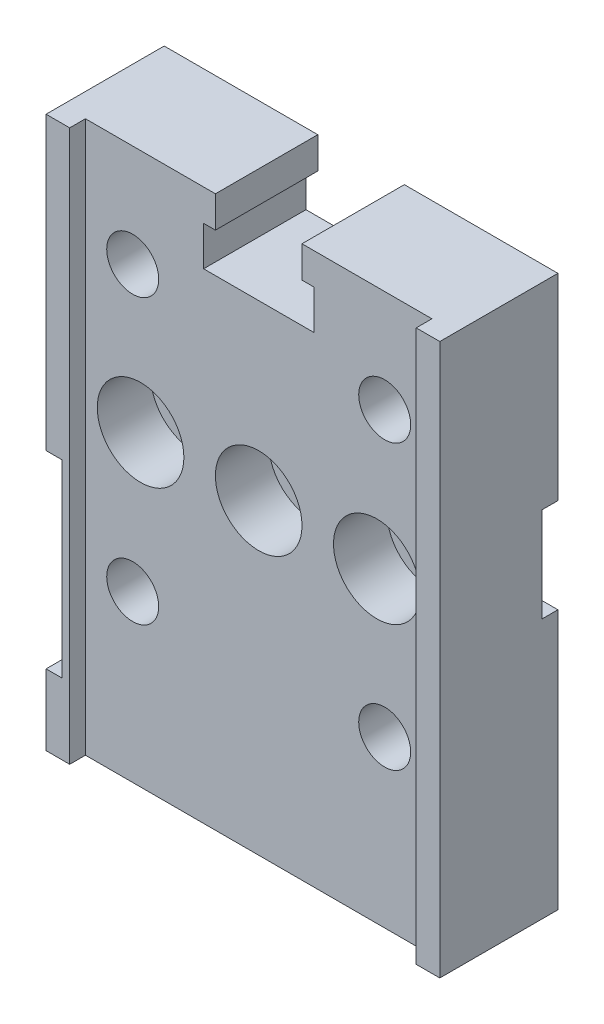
ISO-10303-21;
HEADER;
FILE_DESCRIPTION(('STEP AP214'),'2;1');
FILE_NAME('part.step','',(''),(''),'','','');
FILE_SCHEMA(('AUTOMOTIVE_DESIGN { 1 0 10303 214 1 1 1 1 }'));
ENDSEC;
DATA;
#1=APPLICATION_CONTEXT('core data for automotive mechanical design processes');
#2=APPLICATION_PROTOCOL_DEFINITION('international standard','automotive_design',2000,#1);
#3=PRODUCT_CONTEXT('',#1,'mechanical');
#4=PRODUCT('Part','Part','',(#3));
#5=PRODUCT_RELATED_PRODUCT_CATEGORY('part','',(#4));
#6=PRODUCT_DEFINITION_FORMATION('','',#4);
#7=PRODUCT_DEFINITION_CONTEXT('part definition',#1,'design');
#8=PRODUCT_DEFINITION('design','',#6,#7);
#9=PRODUCT_DEFINITION_SHAPE('','',#8);
#10=(LENGTH_UNIT() NAMED_UNIT(*) SI_UNIT(.MILLI.,.METRE.));
#11=(NAMED_UNIT(*) PLANE_ANGLE_UNIT() SI_UNIT($,.RADIAN.));
#12=(NAMED_UNIT(*) SI_UNIT($,.STERADIAN.) SOLID_ANGLE_UNIT());
#13=UNCERTAINTY_MEASURE_WITH_UNIT(LENGTH_MEASURE(1.E-05),#10,'distance_accuracy_value','');
#14=(GEOMETRIC_REPRESENTATION_CONTEXT(3) GLOBAL_UNCERTAINTY_ASSIGNED_CONTEXT((#13)) GLOBAL_UNIT_ASSIGNED_CONTEXT((#10,
#11,#12)) REPRESENTATION_CONTEXT('',''));
#15=CARTESIAN_POINT('',(0.,0.,0.));
#16=DIRECTION('',(0.,0.,1.));
#17=DIRECTION('',(1.,0.,0.));
#18=AXIS2_PLACEMENT_3D('',#15,#16,#17);
#19=CARTESIAN_POINT('',(-25.,35.,15.));
#20=DIRECTION('',(0.,-1.,0.));
#21=DIRECTION('',(0.,0.,-1.));
#22=AXIS2_PLACEMENT_3D('',#19,#20,#21);
#23=PLANE('',#22);
#24=DIRECTION('',(-1.,0.,0.));
#25=VECTOR('',#24,1.);
#26=CARTESIAN_POINT('',(-25.,35.,0.));
#27=LINE('',#26,#25);
#28=CARTESIAN_POINT('',(25.,35.,0.));
#29=VERTEX_POINT('',#28);
#30=CARTESIAN_POINT('',(5.49553428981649,35.,0.));
#31=VERTEX_POINT('',#30);
#32=EDGE_CURVE('E382',#29,#31,#27,.T.);
#33=ORIENTED_EDGE('',*,*,#32,.T.);
#34=DIRECTION('',(0.,0.,-1.));
#35=VECTOR('',#34,1.);
#36=CARTESIAN_POINT('',(5.49553428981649,35.,15.));
#37=LINE('',#36,#35);
#38=CARTESIAN_POINT('',(5.49553428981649,35.,13.));
#39=VERTEX_POINT('',#38);
#40=EDGE_CURVE('E228',#39,#31,#37,.T.);
#41=ORIENTED_EDGE('',*,*,#40,.F.);
#42=DIRECTION('',(-1.,0.,0.));
#43=VECTOR('',#42,1.);
#44=CARTESIAN_POINT('',(-22.,35.,13.));
#45=LINE('',#44,#43);
#46=CARTESIAN_POINT('',(22.,35.,13.));
#47=VERTEX_POINT('',#46);
#48=EDGE_CURVE('E336',#47,#39,#45,.T.);
#49=ORIENTED_EDGE('',*,*,#48,.F.);
#50=DIRECTION('',(0.,0.,-1.));
#51=VECTOR('',#50,1.);
#52=CARTESIAN_POINT('',(22.,35.,15.));
#53=LINE('',#52,#51);
#54=CARTESIAN_POINT('',(22.,35.,15.));
#55=VERTEX_POINT('',#54);
#56=EDGE_CURVE('E345',#55,#47,#53,.T.);
#57=ORIENTED_EDGE('',*,*,#56,.F.);
#58=DIRECTION('',(-1.,0.,0.));
#59=VECTOR('',#58,1.);
#60=CARTESIAN_POINT('',(-25.,35.,15.));
#61=LINE('',#60,#59);
#62=CARTESIAN_POINT('',(25.,35.,15.));
#63=VERTEX_POINT('',#62);
#64=EDGE_CURVE('E366',#63,#55,#61,.T.);
#65=ORIENTED_EDGE('',*,*,#64,.F.);
#66=DIRECTION('',(0.,0.,-1.));
#67=VECTOR('',#66,1.);
#68=CARTESIAN_POINT('',(25.,35.,15.));
#69=LINE('',#68,#67);
#70=EDGE_CURVE('E398',#63,#29,#69,.T.);
#71=ORIENTED_EDGE('',*,*,#70,.T.);
#72=EDGE_LOOP('',(#33,#41,#49,#57,#65,#71));
#73=FACE_BOUND('',#72,.T.);
#74=ADVANCED_FACE('F16',(#73),#23,.F.);
#75=CARTESIAN_POINT('',(-25.,35.,15.));
#76=DIRECTION('',(1.,0.,0.));
#77=DIRECTION('',(0.,1.,0.));
#78=AXIS2_PLACEMENT_3D('',#75,#76,#77);
#79=PLANE('',#78);
#80=DIRECTION('',(0.,-1.,0.));
#81=VECTOR('',#80,1.);
#82=CARTESIAN_POINT('',(-25.,35.,15.));
#83=LINE('',#82,#81);
#84=CARTESIAN_POINT('',(-25.,-26.,15.));
#85=VERTEX_POINT('',#84);
#86=CARTESIAN_POINT('',(-25.,-35.,15.));
#87=VERTEX_POINT('',#86);
#88=EDGE_CURVE('E369',#85,#87,#83,.T.);
#89=ORIENTED_EDGE('',*,*,#88,.F.);
#90=DIRECTION('',(0.,0.,-1.));
#91=VECTOR('',#90,1.);
#92=CARTESIAN_POINT('',(-25.,-26.,15.));
#93=LINE('',#92,#91);
#94=CARTESIAN_POINT('',(-25.,-26.,0.));
#95=VERTEX_POINT('',#94);
#96=EDGE_CURVE('E260',#85,#95,#93,.T.);
#97=ORIENTED_EDGE('',*,*,#96,.T.);
#98=DIRECTION('',(0.,-1.,0.));
#99=VECTOR('',#98,1.);
#100=CARTESIAN_POINT('',(-25.,35.,0.));
#101=LINE('',#100,#99);
#102=CARTESIAN_POINT('',(-25.,-35.,0.));
#103=VERTEX_POINT('',#102);
#104=EDGE_CURVE('E385',#95,#103,#101,.T.);
#105=ORIENTED_EDGE('',*,*,#104,.T.);
#106=DIRECTION('',(0.,0.,-1.));
#107=VECTOR('',#106,1.);
#108=CARTESIAN_POINT('',(-25.,-35.,15.));
#109=LINE('',#108,#107);
#110=EDGE_CURVE('E392',#87,#103,#109,.T.);
#111=ORIENTED_EDGE('',*,*,#110,.F.);
#112=EDGE_LOOP('',(#89,#97,#105,#111));
#113=FACE_BOUND('',#112,.T.);
#114=ADVANCED_FACE('F498',(#113),#79,.F.);
#115=CARTESIAN_POINT('',(0.,0.,0.));
#116=DIRECTION('',(0.,0.,1.));
#117=DIRECTION('',(1.,0.,0.));
#118=AXIS2_PLACEMENT_3D('',#115,#116,#117);
#119=PLANE('',#118);
#120=CARTESIAN_POINT('',(-16.,-14.,0.));
#121=DIRECTION('',(0.,0.,-1.));
#122=DIRECTION('',(-1.,0.,0.));
#123=AXIS2_PLACEMENT_3D('',#120,#121,#122);
#124=CIRCLE('',#123,5.5);
#125=CARTESIAN_POINT('',(-21.5,-14.,0.));
#126=VERTEX_POINT('',#125);
#127=EDGE_CURVE('E322',#126,#126,#124,.T.);
#128=ORIENTED_EDGE('',*,*,#127,.F.);
#129=EDGE_LOOP('',(#128));
#130=FACE_BOUND('',#129,.T.);
#131=CARTESIAN_POINT('',(16.,-14.,0.));
#132=DIRECTION('',(0.,0.,-1.));
#133=DIRECTION('',(-1.,0.,0.));
#134=AXIS2_PLACEMENT_3D('',#131,#132,#133);
#135=CIRCLE('',#134,5.5);
#136=CARTESIAN_POINT('',(10.5,-14.,0.));
#137=VERTEX_POINT('',#136);
#138=EDGE_CURVE('E312',#137,#137,#135,.T.);
#139=ORIENTED_EDGE('',*,*,#138,.F.);
#140=EDGE_LOOP('',(#139));
#141=FACE_BOUND('',#140,.T.);
#142=ORIENTED_EDGE('',*,*,#104,.F.);
#143=DIRECTION('',(-1.,0.,0.));
#144=VECTOR('',#143,1.);
#145=CARTESIAN_POINT('',(-25.,-26.,0.));
#146=LINE('',#145,#144);
#147=CARTESIAN_POINT('',(-23.,-26.,0.));
#148=VERTEX_POINT('',#147);
#149=EDGE_CURVE('E250',#148,#95,#146,.T.);
#150=ORIENTED_EDGE('',*,*,#149,.F.);
#151=DIRECTION('',(0.,-1.,0.));
#152=VECTOR('',#151,1.);
#153=CARTESIAN_POINT('',(-23.,-2.,0.));
#154=LINE('',#153,#152);
#155=CARTESIAN_POINT('',(-23.,-2.,0.));
#156=VERTEX_POINT('',#155);
#157=EDGE_CURVE('E245',#156,#148,#154,.T.);
#158=ORIENTED_EDGE('',*,*,#157,.F.);
#159=DIRECTION('',(1.,0.,0.));
#160=VECTOR('',#159,1.);
#161=CARTESIAN_POINT('',(-25.,-2.,0.));
#162=LINE('',#161,#160);
#163=CARTESIAN_POINT('',(25.,-2.,0.));
#164=VERTEX_POINT('',#163);
#165=EDGE_CURVE('E284',#156,#164,#162,.T.);
#166=ORIENTED_EDGE('',*,*,#165,.T.);
#167=DIRECTION('',(0.,1.,0.));
#168=VECTOR('',#167,1.);
#169=CARTESIAN_POINT('',(25.,35.,0.));
#170=LINE('',#169,#168);
#171=CARTESIAN_POINT('',(25.,-35.,0.));
#172=VERTEX_POINT('',#171);
#173=EDGE_CURVE('E378',#172,#164,#170,.T.);
#174=ORIENTED_EDGE('',*,*,#173,.F.);
#175=DIRECTION('',(1.,0.,0.));
#176=VECTOR('',#175,1.);
#177=CARTESIAN_POINT('',(-25.,-35.,0.));
#178=LINE('',#177,#176);
#179=EDGE_CURVE('E365',#103,#172,#178,.T.);
#180=ORIENTED_EDGE('',*,*,#179,.F.);
#181=EDGE_LOOP('',(#142,#150,#158,#166,#174,#180));
#182=FACE_BOUND('',#181,.T.);
#183=ADVANCED_FACE('F505',(#130,#141,#182),#119,.F.);
#184=CARTESIAN_POINT('',(0.,0.,15.));
#185=DIRECTION('',(0.,0.,1.));
#186=DIRECTION('',(1.,0.,0.));
#187=AXIS2_PLACEMENT_3D('',#184,#185,#186);
#188=PLANE('',#187);
#189=DIRECTION('',(-1.,0.,0.));
#190=VECTOR('',#189,1.);
#191=CARTESIAN_POINT('',(-25.,-26.,15.));
#192=LINE('',#191,#190);
#193=CARTESIAN_POINT('',(-23.,-26.,15.));
#194=VERTEX_POINT('',#193);
#195=EDGE_CURVE('E253',#194,#85,#192,.T.);
#196=ORIENTED_EDGE('',*,*,#195,.T.);
#197=ORIENTED_EDGE('',*,*,#88,.T.);
#198=DIRECTION('',(1.,0.,0.));
#199=VECTOR('',#198,1.);
#200=CARTESIAN_POINT('',(-25.,-35.,15.));
#201=LINE('',#200,#199);
#202=CARTESIAN_POINT('',(-22.,-35.,15.));
#203=VERTEX_POINT('',#202);
#204=EDGE_CURVE('E374',#87,#203,#201,.T.);
#205=ORIENTED_EDGE('',*,*,#204,.T.);
#206=DIRECTION('',(0.,1.,0.));
#207=VECTOR('',#206,1.);
#208=CARTESIAN_POINT('',(-22.,-35.,15.));
#209=LINE('',#208,#207);
#210=CARTESIAN_POINT('',(-22.,35.,15.));
#211=VERTEX_POINT('',#210);
#212=EDGE_CURVE('E342',#203,#211,#209,.T.);
#213=ORIENTED_EDGE('',*,*,#212,.T.);
#214=CARTESIAN_POINT('',(-25.,35.,15.));
#215=VERTEX_POINT('',#214);
#216=EDGE_CURVE('E364',#211,#215,#61,.T.);
#217=ORIENTED_EDGE('',*,*,#216,.T.);
#218=CARTESIAN_POINT('',(-25.,-2.,15.));
#219=VERTEX_POINT('',#218);
#220=EDGE_CURVE('E370',#215,#219,#83,.T.);
#221=ORIENTED_EDGE('',*,*,#220,.T.);
#222=DIRECTION('',(1.,0.,0.));
#223=VECTOR('',#222,1.);
#224=CARTESIAN_POINT('',(-25.,-2.,15.));
#225=LINE('',#224,#223);
#226=CARTESIAN_POINT('',(-23.,-2.,15.));
#227=VERTEX_POINT('',#226);
#228=EDGE_CURVE('E246',#219,#227,#225,.T.);
#229=ORIENTED_EDGE('',*,*,#228,.T.);
#230=DIRECTION('',(0.,-1.,0.));
#231=VECTOR('',#230,1.);
#232=CARTESIAN_POINT('',(-23.,-2.,15.));
#233=LINE('',#232,#231);
#234=EDGE_CURVE('E249',#227,#194,#233,.T.);
#235=ORIENTED_EDGE('',*,*,#234,.T.);
#236=EDGE_LOOP('',(#196,#197,#205,#213,#217,#221,#229,#235));
#237=FACE_BOUND('',#236,.T.);
#238=ADVANCED_FACE('F518',(#237),#188,.T.);
#239=CARTESIAN_POINT('',(25.,35.,15.));
#240=DIRECTION('',(-1.,0.,0.));
#241=DIRECTION('',(0.,-1.,0.));
#242=AXIS2_PLACEMENT_3D('',#239,#240,#241);
#243=PLANE('',#242);
#244=ORIENTED_EDGE('',*,*,#173,.T.);
#245=DIRECTION('',(0.,0.,-1.));
#246=VECTOR('',#245,1.);
#247=CARTESIAN_POINT('',(25.,-2.,0.));
#248=LINE('',#247,#246);
#249=CARTESIAN_POINT('',(25.,-2.,2.));
#250=VERTEX_POINT('',#249);
#251=EDGE_CURVE('E273',#250,#164,#248,.T.);
#252=ORIENTED_EDGE('',*,*,#251,.F.);
#253=DIRECTION('',(0.,-1.,0.));
#254=VECTOR('',#253,1.);
#255=CARTESIAN_POINT('',(25.,10.,2.));
#256=LINE('',#255,#254);
#257=CARTESIAN_POINT('',(25.,10.,2.));
#258=VERTEX_POINT('',#257);
#259=EDGE_CURVE('E279',#258,#250,#256,.T.);
#260=ORIENTED_EDGE('',*,*,#259,.F.);
#261=DIRECTION('',(0.,0.,1.));
#262=VECTOR('',#261,1.);
#263=CARTESIAN_POINT('',(25.,10.,0.));
#264=LINE('',#263,#262);
#265=CARTESIAN_POINT('',(25.,10.,0.));
#266=VERTEX_POINT('',#265);
#267=EDGE_CURVE('E263',#266,#258,#264,.T.);
#268=ORIENTED_EDGE('',*,*,#267,.F.);
#269=EDGE_CURVE('E354',#266,#29,#170,.T.);
#270=ORIENTED_EDGE('',*,*,#269,.T.);
#271=ORIENTED_EDGE('',*,*,#70,.F.);
#272=DIRECTION('',(0.,1.,0.));
#273=VECTOR('',#272,1.);
#274=CARTESIAN_POINT('',(25.,35.,15.));
#275=LINE('',#274,#273);
#276=CARTESIAN_POINT('',(25.,-35.,15.));
#277=VERTEX_POINT('',#276);
#278=EDGE_CURVE('E361',#277,#63,#275,.T.);
#279=ORIENTED_EDGE('',*,*,#278,.F.);
#280=DIRECTION('',(0.,0.,-1.));
#281=VECTOR('',#280,1.);
#282=CARTESIAN_POINT('',(25.,-35.,15.));
#283=LINE('',#282,#281);
#284=EDGE_CURVE('E377',#277,#172,#283,.T.);
#285=ORIENTED_EDGE('',*,*,#284,.T.);
#286=EDGE_LOOP('',(#244,#252,#260,#268,#270,#271,#279,#285));
#287=FACE_BOUND('',#286,.T.);
#288=ADVANCED_FACE('F18',(#287),#243,.F.);
#289=CARTESIAN_POINT('',(-5.49553428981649,35.,13.));
#290=VERTEX_POINT('',#289);
#291=CARTESIAN_POINT('',(-22.,35.,13.));
#292=VERTEX_POINT('',#291);
#293=EDGE_CURVE('E348',#290,#292,#45,.T.);
#294=ORIENTED_EDGE('',*,*,#293,.F.);
#295=DIRECTION('',(0.,0.,-1.));
#296=VECTOR('',#295,1.);
#297=CARTESIAN_POINT('',(-5.49553428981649,35.,15.));
#298=LINE('',#297,#296);
#299=CARTESIAN_POINT('',(-5.49553428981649,35.,0.));
#300=VERTEX_POINT('',#299);
#301=EDGE_CURVE('E230',#290,#300,#298,.T.);
#302=ORIENTED_EDGE('',*,*,#301,.T.);
#303=CARTESIAN_POINT('',(-25.,35.,0.));
#304=VERTEX_POINT('',#303);
#305=EDGE_CURVE('E381',#300,#304,#27,.T.);
#306=ORIENTED_EDGE('',*,*,#305,.T.);
#307=DIRECTION('',(0.,0.,-1.));
#308=VECTOR('',#307,1.);
#309=CARTESIAN_POINT('',(-25.,35.,15.));
#310=LINE('',#309,#308);
#311=EDGE_CURVE('E395',#215,#304,#310,.T.);
#312=ORIENTED_EDGE('',*,*,#311,.F.);
#313=ORIENTED_EDGE('',*,*,#216,.F.);
#314=DIRECTION('',(0.,0.,1.));
#315=VECTOR('',#314,1.);
#316=CARTESIAN_POINT('',(-22.,35.,15.));
#317=LINE('',#316,#315);
#318=EDGE_CURVE('E343',#292,#211,#317,.T.);
#319=ORIENTED_EDGE('',*,*,#318,.F.);
#320=EDGE_LOOP('',(#294,#302,#306,#312,#313,#319));
#321=FACE_BOUND('',#320,.T.);
#322=ADVANCED_FACE('F500',(#321),#23,.F.);
#323=DIRECTION('',(0.,-1.,0.));
#324=VECTOR('',#323,1.);
#325=CARTESIAN_POINT('',(-25.,10.,2.));
#326=LINE('',#325,#324);
#327=CARTESIAN_POINT('',(-25.,10.,2.));
#328=VERTEX_POINT('',#327);
#329=CARTESIAN_POINT('',(-25.,-2.,2.));
#330=VERTEX_POINT('',#329);
#331=EDGE_CURVE('E272',#328,#330,#326,.T.);
#332=ORIENTED_EDGE('',*,*,#331,.T.);
#333=DIRECTION('',(0.,0.,-1.));
#334=VECTOR('',#333,1.);
#335=CARTESIAN_POINT('',(-25.,-2.,15.));
#336=LINE('',#335,#334);
#337=EDGE_CURVE('E256',#219,#330,#336,.T.);
#338=ORIENTED_EDGE('',*,*,#337,.F.);
#339=ORIENTED_EDGE('',*,*,#220,.F.);
#340=ORIENTED_EDGE('',*,*,#311,.T.);
#341=CARTESIAN_POINT('',(-25.,10.,0.));
#342=VERTEX_POINT('',#341);
#343=EDGE_CURVE('E386',#304,#342,#101,.T.);
#344=ORIENTED_EDGE('',*,*,#343,.T.);
#345=DIRECTION('',(0.,0.,1.));
#346=VECTOR('',#345,1.);
#347=CARTESIAN_POINT('',(-25.,10.,0.));
#348=LINE('',#347,#346);
#349=EDGE_CURVE('E41',#342,#328,#348,.T.);
#350=ORIENTED_EDGE('',*,*,#349,.T.);
#351=EDGE_LOOP('',(#332,#338,#339,#340,#344,#350));
#352=FACE_BOUND('',#351,.T.);
#353=ADVANCED_FACE('F508',(#352),#79,.F.);
#354=CARTESIAN_POINT('',(-25.,-35.,15.));
#355=DIRECTION('',(0.,1.,0.));
#356=DIRECTION('',(0.,0.,1.));
#357=AXIS2_PLACEMENT_3D('',#354,#355,#356);
#358=PLANE('',#357);
#359=DIRECTION('',(-1.,0.,0.));
#360=VECTOR('',#359,1.);
#361=CARTESIAN_POINT('',(-22.,-35.,13.));
#362=LINE('',#361,#360);
#363=CARTESIAN_POINT('',(22.,-35.,13.));
#364=VERTEX_POINT('',#363);
#365=CARTESIAN_POINT('',(-22.,-35.,13.));
#366=VERTEX_POINT('',#365);
#367=EDGE_CURVE('E339',#364,#366,#362,.T.);
#368=ORIENTED_EDGE('',*,*,#367,.T.);
#369=DIRECTION('',(0.,0.,1.));
#370=VECTOR('',#369,1.);
#371=CARTESIAN_POINT('',(-22.,-35.,15.));
#372=LINE('',#371,#370);
#373=EDGE_CURVE('E332',#366,#203,#372,.T.);
#374=ORIENTED_EDGE('',*,*,#373,.T.);
#375=ORIENTED_EDGE('',*,*,#204,.F.);
#376=ORIENTED_EDGE('',*,*,#110,.T.);
#377=ORIENTED_EDGE('',*,*,#179,.T.);
#378=ORIENTED_EDGE('',*,*,#284,.F.);
#379=CARTESIAN_POINT('',(22.,-35.,15.));
#380=VERTEX_POINT('',#379);
#381=EDGE_CURVE('E373',#380,#277,#201,.T.);
#382=ORIENTED_EDGE('',*,*,#381,.F.);
#383=DIRECTION('',(0.,0.,-1.));
#384=VECTOR('',#383,1.);
#385=CARTESIAN_POINT('',(22.,-35.,15.));
#386=LINE('',#385,#384);
#387=EDGE_CURVE('E335',#380,#364,#386,.T.);
#388=ORIENTED_EDGE('',*,*,#387,.T.);
#389=EDGE_LOOP('',(#368,#374,#375,#376,#377,#378,#382,#388));
#390=FACE_BOUND('',#389,.T.);
#391=ADVANCED_FACE('F516',(#390),#358,.F.);
#392=DIRECTION('',(0.,1.,0.));
#393=VECTOR('',#392,1.);
#394=CARTESIAN_POINT('',(22.,-35.,15.));
#395=LINE('',#394,#393);
#396=EDGE_CURVE('E357',#380,#55,#395,.T.);
#397=ORIENTED_EDGE('',*,*,#396,.F.);
#398=ORIENTED_EDGE('',*,*,#381,.T.);
#399=ORIENTED_EDGE('',*,*,#278,.T.);
#400=ORIENTED_EDGE('',*,*,#64,.T.);
#401=EDGE_LOOP('',(#397,#398,#399,#400));
#402=FACE_BOUND('',#401,.T.);
#403=ADVANCED_FACE('F677',(#402),#188,.T.);
#404=CARTESIAN_POINT('',(-16.,22.,0.));
#405=DIRECTION('',(0.,0.,-1.));
#406=DIRECTION('',(-1.,0.,0.));
#407=AXIS2_PLACEMENT_3D('',#404,#405,#406);
#408=CIRCLE('',#407,5.5);
#409=CARTESIAN_POINT('',(-21.5,22.,0.));
#410=VERTEX_POINT('',#409);
#411=EDGE_CURVE('E286',#410,#410,#408,.T.);
#412=ORIENTED_EDGE('',*,*,#411,.F.);
#413=EDGE_LOOP('',(#412));
#414=FACE_BOUND('',#413,.T.);
#415=CARTESIAN_POINT('',(16.,22.,0.));
#416=DIRECTION('',(0.,0.,-1.));
#417=DIRECTION('',(-1.,0.,0.));
#418=AXIS2_PLACEMENT_3D('',#415,#416,#417);
#419=CIRCLE('',#418,5.5);
#420=CARTESIAN_POINT('',(10.5,22.,0.));
#421=VERTEX_POINT('',#420);
#422=EDGE_CURVE('E302',#421,#421,#419,.T.);
#423=ORIENTED_EDGE('',*,*,#422,.F.);
#424=EDGE_LOOP('',(#423));
#425=FACE_BOUND('',#424,.T.);
#426=DIRECTION('',(1.,0.,0.));
#427=VECTOR('',#426,1.);
#428=CARTESIAN_POINT('',(6.99553428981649,31.,0.));
#429=LINE('',#428,#427);
#430=CARTESIAN_POINT('',(5.49553428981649,31.,0.));
#431=VERTEX_POINT('',#430);
#432=CARTESIAN_POINT('',(6.99553428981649,31.,0.));
#433=VERTEX_POINT('',#432);
#434=EDGE_CURVE('E213',#431,#433,#429,.T.);
#435=ORIENTED_EDGE('',*,*,#434,.F.);
#436=DIRECTION('',(0.,-1.,0.));
#437=VECTOR('',#436,1.);
#438=CARTESIAN_POINT('',(5.49553428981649,31.,0.));
#439=LINE('',#438,#437);
#440=EDGE_CURVE('E207',#31,#431,#439,.T.);
#441=ORIENTED_EDGE('',*,*,#440,.F.);
#442=ORIENTED_EDGE('',*,*,#32,.F.);
#443=ORIENTED_EDGE('',*,*,#269,.F.);
#444=DIRECTION('',(1.,0.,0.));
#445=VECTOR('',#444,1.);
#446=CARTESIAN_POINT('',(-25.,10.,0.));
#447=LINE('',#446,#445);
#448=EDGE_CURVE('E276',#342,#266,#447,.T.);
#449=ORIENTED_EDGE('',*,*,#448,.F.);
#450=ORIENTED_EDGE('',*,*,#343,.F.);
#451=ORIENTED_EDGE('',*,*,#305,.F.);
#452=DIRECTION('',(0.,1.,0.));
#453=VECTOR('',#452,1.);
#454=CARTESIAN_POINT('',(-5.49553428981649,31.,0.));
#455=LINE('',#454,#453);
#456=CARTESIAN_POINT('',(-5.49553428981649,31.,0.));
#457=VERTEX_POINT('',#456);
#458=EDGE_CURVE('E205',#457,#300,#455,.T.);
#459=ORIENTED_EDGE('',*,*,#458,.F.);
#460=DIRECTION('',(1.,0.,0.));
#461=VECTOR('',#460,1.);
#462=CARTESIAN_POINT('',(-6.99553428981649,31.,0.));
#463=LINE('',#462,#461);
#464=CARTESIAN_POINT('',(-6.99553428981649,31.,0.));
#465=VERTEX_POINT('',#464);
#466=EDGE_CURVE('E184',#465,#457,#463,.T.);
#467=ORIENTED_EDGE('',*,*,#466,.F.);
#468=DIRECTION('',(0.,1.,0.));
#469=VECTOR('',#468,1.);
#470=CARTESIAN_POINT('',(-6.99553428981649,26.,0.));
#471=LINE('',#470,#469);
#472=CARTESIAN_POINT('',(-6.99553428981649,26.,0.));
#473=VERTEX_POINT('',#472);
#474=EDGE_CURVE('E193',#473,#465,#471,.T.);
#475=ORIENTED_EDGE('',*,*,#474,.F.);
#476=DIRECTION('',(-1.,0.,0.));
#477=VECTOR('',#476,1.);
#478=CARTESIAN_POINT('',(6.99553428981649,26.,0.));
#479=LINE('',#478,#477);
#480=CARTESIAN_POINT('',(6.99553428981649,26.,0.));
#481=VERTEX_POINT('',#480);
#482=EDGE_CURVE('E190',#481,#473,#479,.T.);
#483=ORIENTED_EDGE('',*,*,#482,.F.);
#484=DIRECTION('',(0.,-1.,0.));
#485=VECTOR('',#484,1.);
#486=CARTESIAN_POINT('',(6.99553428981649,26.,0.));
#487=LINE('',#486,#485);
#488=EDGE_CURVE('E216',#433,#481,#487,.T.);
#489=ORIENTED_EDGE('',*,*,#488,.F.);
#490=EDGE_LOOP('',(#435,#441,#442,#443,#449,#450,#451,#459,#467,#475,#483,#489));
#491=FACE_BOUND('',#490,.T.);
#492=ADVANCED_FACE('F203',(#414,#425,#491),#119,.F.);
#493=CARTESIAN_POINT('',(-22.,-35.,15.));
#494=DIRECTION('',(-1.,0.,0.));
#495=DIRECTION('',(0.,0.,1.));
#496=AXIS2_PLACEMENT_3D('',#493,#494,#495);
#497=PLANE('',#496);
#498=ORIENTED_EDGE('',*,*,#318,.T.);
#499=ORIENTED_EDGE('',*,*,#212,.F.);
#500=ORIENTED_EDGE('',*,*,#373,.F.);
#501=DIRECTION('',(0.,1.,0.));
#502=VECTOR('',#501,1.);
#503=CARTESIAN_POINT('',(-22.,-35.,13.));
#504=LINE('',#503,#502);
#505=EDGE_CURVE('E351',#366,#292,#504,.T.);
#506=ORIENTED_EDGE('',*,*,#505,.T.);
#507=EDGE_LOOP('',(#498,#499,#500,#506));
#508=FACE_BOUND('',#507,.T.);
#509=ADVANCED_FACE('F468',(#508),#497,.F.);
#510=CARTESIAN_POINT('',(-22.,-35.,13.));
#511=DIRECTION('',(0.,0.,-1.));
#512=DIRECTION('',(-1.,0.,0.));
#513=AXIS2_PLACEMENT_3D('',#510,#511,#512);
#514=PLANE('',#513);
#515=CARTESIAN_POINT('',(-15.,4.,13.));
#516=DIRECTION('',(0.,0.,1.));
#517=DIRECTION('',(1.,0.,0.));
#518=AXIS2_PLACEMENT_3D('',#515,#516,#517);
#519=CIRCLE('',#518,5.5);
#520=CARTESIAN_POINT('',(-9.5,4.,13.));
#521=VERTEX_POINT('',#520);
#522=EDGE_CURVE('E1013',#521,#521,#519,.T.);
#523=ORIENTED_EDGE('',*,*,#522,.F.);
#524=EDGE_LOOP('',(#523));
#525=FACE_BOUND('',#524,.T.);
#526=CARTESIAN_POINT('',(0.,4.,13.));
#527=DIRECTION('',(0.,0.,1.));
#528=DIRECTION('',(1.,0.,0.));
#529=AXIS2_PLACEMENT_3D('',#526,#527,#528);
#530=CIRCLE('',#529,5.5);
#531=CARTESIAN_POINT('',(5.5,4.,13.));
#532=VERTEX_POINT('',#531);
#533=EDGE_CURVE('E440',#532,#532,#530,.T.);
#534=ORIENTED_EDGE('',*,*,#533,.F.);
#535=EDGE_LOOP('',(#534));
#536=FACE_BOUND('',#535,.T.);
#537=CARTESIAN_POINT('',(15.,4.,13.));
#538=DIRECTION('',(0.,0.,1.));
#539=DIRECTION('',(1.,0.,0.));
#540=AXIS2_PLACEMENT_3D('',#537,#538,#539);
#541=CIRCLE('',#540,5.5);
#542=CARTESIAN_POINT('',(20.5,4.,13.));
#543=VERTEX_POINT('',#542);
#544=EDGE_CURVE('E427',#543,#543,#541,.T.);
#545=ORIENTED_EDGE('',*,*,#544,.F.);
#546=EDGE_LOOP('',(#545));
#547=FACE_BOUND('',#546,.T.);
#548=ORIENTED_EDGE('',*,*,#48,.T.);
#549=DIRECTION('',(0.,-1.,0.));
#550=VECTOR('',#549,1.);
#551=CARTESIAN_POINT('',(5.49553428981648,-35.,13.));
#552=LINE('',#551,#550);
#553=CARTESIAN_POINT('',(5.49553428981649,31.,13.));
#554=VERTEX_POINT('',#553);
#555=EDGE_CURVE('E11',#39,#554,#552,.T.);
#556=ORIENTED_EDGE('',*,*,#555,.T.);
#557=DIRECTION('',(1.,0.,0.));
#558=VECTOR('',#557,1.);
#559=CARTESIAN_POINT('',(-22.,31.,13.));
#560=LINE('',#559,#558);
#561=CARTESIAN_POINT('',(6.99553428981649,31.,13.));
#562=VERTEX_POINT('',#561);
#563=EDGE_CURVE('E25',#554,#562,#560,.T.);
#564=ORIENTED_EDGE('',*,*,#563,.T.);
#565=DIRECTION('',(0.,-1.,0.));
#566=VECTOR('',#565,1.);
#567=CARTESIAN_POINT('',(6.99553428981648,-35.,13.));
#568=LINE('',#567,#566);
#569=CARTESIAN_POINT('',(6.99553428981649,26.,13.));
#570=VERTEX_POINT('',#569);
#571=EDGE_CURVE('E418',#562,#570,#568,.T.);
#572=ORIENTED_EDGE('',*,*,#571,.T.);
#573=DIRECTION('',(-1.,0.,0.));
#574=VECTOR('',#573,1.);
#575=CARTESIAN_POINT('',(-22.,26.,13.));
#576=LINE('',#575,#574);
#577=CARTESIAN_POINT('',(-6.99553428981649,26.,13.));
#578=VERTEX_POINT('',#577);
#579=EDGE_CURVE('E415',#570,#578,#576,.T.);
#580=ORIENTED_EDGE('',*,*,#579,.T.);
#581=DIRECTION('',(0.,1.,0.));
#582=VECTOR('',#581,1.);
#583=CARTESIAN_POINT('',(-6.99553428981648,-35.,13.));
#584=LINE('',#583,#582);
#585=CARTESIAN_POINT('',(-6.99553428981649,31.,13.));
#586=VERTEX_POINT('',#585);
#587=EDGE_CURVE('E413',#578,#586,#584,.T.);
#588=ORIENTED_EDGE('',*,*,#587,.T.);
#589=DIRECTION('',(1.,0.,0.));
#590=VECTOR('',#589,1.);
#591=CARTESIAN_POINT('',(-22.,31.,13.));
#592=LINE('',#591,#590);
#593=CARTESIAN_POINT('',(-5.49553428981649,31.,13.));
#594=VERTEX_POINT('',#593);
#595=EDGE_CURVE('E187',#586,#594,#592,.T.);
#596=ORIENTED_EDGE('',*,*,#595,.T.);
#597=DIRECTION('',(0.,1.,0.));
#598=VECTOR('',#597,1.);
#599=CARTESIAN_POINT('',(-5.49553428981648,-35.,13.));
#600=LINE('',#599,#598);
#601=EDGE_CURVE('E410',#594,#290,#600,.T.);
#602=ORIENTED_EDGE('',*,*,#601,.T.);
#603=ORIENTED_EDGE('',*,*,#293,.T.);
#604=ORIENTED_EDGE('',*,*,#505,.F.);
#605=ORIENTED_EDGE('',*,*,#367,.F.);
#606=DIRECTION('',(0.,1.,0.));
#607=VECTOR('',#606,1.);
#608=CARTESIAN_POINT('',(22.,-35.,13.));
#609=LINE('',#608,#607);
#610=EDGE_CURVE('E355',#364,#47,#609,.T.);
#611=ORIENTED_EDGE('',*,*,#610,.T.);
#612=EDGE_LOOP('',(#548,#556,#564,#572,#580,#588,#596,#602,#603,#604,#605,#611));
#613=FACE_BOUND('',#612,.T.);
#614=CARTESIAN_POINT('',(-16.,22.,13.));
#615=DIRECTION('',(0.,0.,-1.));
#616=DIRECTION('',(-1.,0.,0.));
#617=AXIS2_PLACEMENT_3D('',#614,#615,#616);
#618=CIRCLE('',#617,3.3);
#619=CARTESIAN_POINT('',(-19.3,22.,13.));
#620=VERTEX_POINT('',#619);
#621=EDGE_CURVE('E301',#620,#620,#618,.T.);
#622=ORIENTED_EDGE('',*,*,#621,.T.);
#623=EDGE_LOOP('',(#622));
#624=FACE_BOUND('',#623,.T.);
#625=CARTESIAN_POINT('',(16.,22.,13.));
#626=DIRECTION('',(0.,0.,-1.));
#627=DIRECTION('',(-1.,0.,0.));
#628=AXIS2_PLACEMENT_3D('',#625,#626,#627);
#629=CIRCLE('',#628,3.3);
#630=CARTESIAN_POINT('',(12.7,22.,13.));
#631=VERTEX_POINT('',#630);
#632=EDGE_CURVE('E311',#631,#631,#629,.T.);
#633=ORIENTED_EDGE('',*,*,#632,.T.);
#634=EDGE_LOOP('',(#633));
#635=FACE_BOUND('',#634,.T.);
#636=CARTESIAN_POINT('',(16.,-14.,13.));
#637=DIRECTION('',(0.,0.,-1.));
#638=DIRECTION('',(-1.,0.,0.));
#639=AXIS2_PLACEMENT_3D('',#636,#637,#638);
#640=CIRCLE('',#639,3.3);
#641=CARTESIAN_POINT('',(12.7,-14.,13.));
#642=VERTEX_POINT('',#641);
#643=EDGE_CURVE('E321',#642,#642,#640,.T.);
#644=ORIENTED_EDGE('',*,*,#643,.T.);
#645=EDGE_LOOP('',(#644));
#646=FACE_BOUND('',#645,.T.);
#647=CARTESIAN_POINT('',(-16.,-14.,13.));
#648=DIRECTION('',(0.,0.,-1.));
#649=DIRECTION('',(-1.,0.,0.));
#650=AXIS2_PLACEMENT_3D('',#647,#648,#649);
#651=CIRCLE('',#650,3.3);
#652=CARTESIAN_POINT('',(-19.3,-14.,13.));
#653=VERTEX_POINT('',#652);
#654=EDGE_CURVE('E331',#653,#653,#651,.T.);
#655=ORIENTED_EDGE('',*,*,#654,.T.);
#656=EDGE_LOOP('',(#655));
#657=FACE_BOUND('',#656,.T.);
#658=ADVANCED_FACE('F464',(#525,#536,#547,#613,#624,#635,#646,#657),#514,.F.);
#659=CARTESIAN_POINT('',(22.,-35.,15.));
#660=DIRECTION('',(1.,0.,0.));
#661=DIRECTION('',(0.,0.,-1.));
#662=AXIS2_PLACEMENT_3D('',#659,#660,#661);
#663=PLANE('',#662);
#664=ORIENTED_EDGE('',*,*,#56,.T.);
#665=ORIENTED_EDGE('',*,*,#610,.F.);
#666=ORIENTED_EDGE('',*,*,#387,.F.);
#667=ORIENTED_EDGE('',*,*,#396,.T.);
#668=EDGE_LOOP('',(#664,#665,#666,#667));
#669=FACE_BOUND('',#668,.T.);
#670=ADVANCED_FACE('F467',(#669),#663,.F.);
#671=CARTESIAN_POINT('',(-16.,-14.,0.));
#672=DIRECTION('',(0.,0.,-1.));
#673=DIRECTION('',(-1.,0.,0.));
#674=AXIS2_PLACEMENT_3D('',#671,#672,#673);
#675=CYLINDRICAL_SURFACE('',#674,3.3);
#676=CARTESIAN_POINT('',(-16.,-14.,6.8));
#677=DIRECTION('',(0.,0.,-1.));
#678=DIRECTION('',(-1.,0.,0.));
#679=AXIS2_PLACEMENT_3D('',#676,#677,#678);
#680=CIRCLE('',#679,3.3);
#681=CARTESIAN_POINT('',(-19.3,-14.,6.8));
#682=VERTEX_POINT('',#681);
#683=EDGE_CURVE('E328',#682,#682,#680,.T.);
#684=ORIENTED_EDGE('',*,*,#683,.T.);
#685=EDGE_LOOP('',(#684));
#686=FACE_BOUND('',#685,.T.);
#687=ORIENTED_EDGE('',*,*,#654,.F.);
#688=EDGE_LOOP('',(#687));
#689=FACE_BOUND('',#688,.T.);
#690=ADVANCED_FACE('F481',(#686,#689),#675,.F.);
#691=CARTESIAN_POINT('',(-12.7,-14.,6.8));
#692=DIRECTION('',(0.,0.,1.));
#693=DIRECTION('',(1.,0.,0.));
#694=AXIS2_PLACEMENT_3D('',#691,#692,#693);
#695=PLANE('',#694);
#696=ORIENTED_EDGE('',*,*,#683,.F.);
#697=EDGE_LOOP('',(#696));
#698=FACE_BOUND('',#697,.T.);
#699=CARTESIAN_POINT('',(-16.,-14.,6.8));
#700=DIRECTION('',(0.,0.,-1.));
#701=DIRECTION('',(-1.,0.,0.));
#702=AXIS2_PLACEMENT_3D('',#699,#700,#701);
#703=CIRCLE('',#702,5.5);
#704=CARTESIAN_POINT('',(-21.5,-14.,6.8));
#705=VERTEX_POINT('',#704);
#706=EDGE_CURVE('E325',#705,#705,#703,.T.);
#707=ORIENTED_EDGE('',*,*,#706,.T.);
#708=EDGE_LOOP('',(#707));
#709=FACE_BOUND('',#708,.T.);
#710=ADVANCED_FACE('F483',(#698,#709),#695,.F.);
#711=CARTESIAN_POINT('',(-16.,-14.,0.));
#712=DIRECTION('',(0.,0.,-1.));
#713=DIRECTION('',(-1.,0.,0.));
#714=AXIS2_PLACEMENT_3D('',#711,#712,#713);
#715=CYLINDRICAL_SURFACE('',#714,5.5);
#716=ORIENTED_EDGE('',*,*,#706,.F.);
#717=EDGE_LOOP('',(#716));
#718=FACE_BOUND('',#717,.T.);
#719=ORIENTED_EDGE('',*,*,#127,.T.);
#720=EDGE_LOOP('',(#719));
#721=FACE_BOUND('',#720,.T.);
#722=ADVANCED_FACE('F492',(#718,#721),#715,.F.);
#723=CARTESIAN_POINT('',(16.,-14.,0.));
#724=DIRECTION('',(0.,0.,-1.));
#725=DIRECTION('',(-1.,0.,0.));
#726=AXIS2_PLACEMENT_3D('',#723,#724,#725);
#727=CYLINDRICAL_SURFACE('',#726,3.3);
#728=CARTESIAN_POINT('',(16.,-14.,6.8));
#729=DIRECTION('',(0.,0.,-1.));
#730=DIRECTION('',(-1.,0.,0.));
#731=AXIS2_PLACEMENT_3D('',#728,#729,#730);
#732=CIRCLE('',#731,3.3);
#733=CARTESIAN_POINT('',(12.7,-14.,6.8));
#734=VERTEX_POINT('',#733);
#735=EDGE_CURVE('E318',#734,#734,#732,.T.);
#736=ORIENTED_EDGE('',*,*,#735,.T.);
#737=EDGE_LOOP('',(#736));
#738=FACE_BOUND('',#737,.T.);
#739=ORIENTED_EDGE('',*,*,#643,.F.);
#740=EDGE_LOOP('',(#739));
#741=FACE_BOUND('',#740,.T.);
#742=ADVANCED_FACE('F638',(#738,#741),#727,.F.);
#743=CARTESIAN_POINT('',(19.3,-14.,6.8));
#744=DIRECTION('',(0.,0.,1.));
#745=DIRECTION('',(1.,0.,0.));
#746=AXIS2_PLACEMENT_3D('',#743,#744,#745);
#747=PLANE('',#746);
#748=ORIENTED_EDGE('',*,*,#735,.F.);
#749=EDGE_LOOP('',(#748));
#750=FACE_BOUND('',#749,.T.);
#751=CARTESIAN_POINT('',(16.,-14.,6.8));
#752=DIRECTION('',(0.,0.,-1.));
#753=DIRECTION('',(-1.,0.,0.));
#754=AXIS2_PLACEMENT_3D('',#751,#752,#753);
#755=CIRCLE('',#754,5.5);
#756=CARTESIAN_POINT('',(10.5,-14.,6.8));
#757=VERTEX_POINT('',#756);
#758=EDGE_CURVE('E315',#757,#757,#755,.T.);
#759=ORIENTED_EDGE('',*,*,#758,.T.);
#760=EDGE_LOOP('',(#759));
#761=FACE_BOUND('',#760,.T.);
#762=ADVANCED_FACE('F634',(#750,#761),#747,.F.);
#763=CARTESIAN_POINT('',(16.,-14.,0.));
#764=DIRECTION('',(0.,0.,-1.));
#765=DIRECTION('',(-1.,0.,0.));
#766=AXIS2_PLACEMENT_3D('',#763,#764,#765);
#767=CYLINDRICAL_SURFACE('',#766,5.5);
#768=ORIENTED_EDGE('',*,*,#758,.F.);
#769=EDGE_LOOP('',(#768));
#770=FACE_BOUND('',#769,.T.);
#771=ORIENTED_EDGE('',*,*,#138,.T.);
#772=EDGE_LOOP('',(#771));
#773=FACE_BOUND('',#772,.T.);
#774=ADVANCED_FACE('F630',(#770,#773),#767,.F.);
#775=CARTESIAN_POINT('',(16.,22.,0.));
#776=DIRECTION('',(0.,0.,-1.));
#777=DIRECTION('',(-1.,0.,0.));
#778=AXIS2_PLACEMENT_3D('',#775,#776,#777);
#779=CYLINDRICAL_SURFACE('',#778,3.3);
#780=CARTESIAN_POINT('',(16.,22.,6.8));
#781=DIRECTION('',(0.,0.,-1.));
#782=DIRECTION('',(-1.,0.,0.));
#783=AXIS2_PLACEMENT_3D('',#780,#781,#782);
#784=CIRCLE('',#783,3.3);
#785=CARTESIAN_POINT('',(12.7,22.,6.8));
#786=VERTEX_POINT('',#785);
#787=EDGE_CURVE('E308',#786,#786,#784,.T.);
#788=ORIENTED_EDGE('',*,*,#787,.T.);
#789=EDGE_LOOP('',(#788));
#790=FACE_BOUND('',#789,.T.);
#791=ORIENTED_EDGE('',*,*,#632,.F.);
#792=EDGE_LOOP('',(#791));
#793=FACE_BOUND('',#792,.T.);
#794=ADVANCED_FACE('F626',(#790,#793),#779,.F.);
#795=CARTESIAN_POINT('',(19.3,22.,6.8));
#796=DIRECTION('',(0.,0.,1.));
#797=DIRECTION('',(1.,0.,0.));
#798=AXIS2_PLACEMENT_3D('',#795,#796,#797);
#799=PLANE('',#798);
#800=ORIENTED_EDGE('',*,*,#787,.F.);
#801=EDGE_LOOP('',(#800));
#802=FACE_BOUND('',#801,.T.);
#803=CARTESIAN_POINT('',(16.,22.,6.8));
#804=DIRECTION('',(0.,0.,-1.));
#805=DIRECTION('',(-1.,0.,0.));
#806=AXIS2_PLACEMENT_3D('',#803,#804,#805);
#807=CIRCLE('',#806,5.5);
#808=CARTESIAN_POINT('',(10.5,22.,6.8));
#809=VERTEX_POINT('',#808);
#810=EDGE_CURVE('E305',#809,#809,#807,.T.);
#811=ORIENTED_EDGE('',*,*,#810,.T.);
#812=EDGE_LOOP('',(#811));
#813=FACE_BOUND('',#812,.T.);
#814=ADVANCED_FACE('F622',(#802,#813),#799,.F.);
#815=CARTESIAN_POINT('',(16.,22.,0.));
#816=DIRECTION('',(0.,0.,-1.));
#817=DIRECTION('',(-1.,0.,0.));
#818=AXIS2_PLACEMENT_3D('',#815,#816,#817);
#819=CYLINDRICAL_SURFACE('',#818,5.5);
#820=ORIENTED_EDGE('',*,*,#810,.F.);
#821=EDGE_LOOP('',(#820));
#822=FACE_BOUND('',#821,.T.);
#823=ORIENTED_EDGE('',*,*,#422,.T.);
#824=EDGE_LOOP('',(#823));
#825=FACE_BOUND('',#824,.T.);
#826=ADVANCED_FACE('F618',(#822,#825),#819,.F.);
#827=CARTESIAN_POINT('',(-16.,22.,0.));
#828=DIRECTION('',(0.,0.,-1.));
#829=DIRECTION('',(-1.,0.,0.));
#830=AXIS2_PLACEMENT_3D('',#827,#828,#829);
#831=CYLINDRICAL_SURFACE('',#830,3.3);
#832=CARTESIAN_POINT('',(-16.,22.,6.8));
#833=DIRECTION('',(0.,0.,-1.));
#834=DIRECTION('',(-1.,0.,0.));
#835=AXIS2_PLACEMENT_3D('',#832,#833,#834);
#836=CIRCLE('',#835,3.3);
#837=CARTESIAN_POINT('',(-19.3,22.,6.8));
#838=VERTEX_POINT('',#837);
#839=EDGE_CURVE('E298',#838,#838,#836,.T.);
#840=ORIENTED_EDGE('',*,*,#839,.T.);
#841=EDGE_LOOP('',(#840));
#842=FACE_BOUND('',#841,.T.);
#843=ORIENTED_EDGE('',*,*,#621,.F.);
#844=EDGE_LOOP('',(#843));
#845=FACE_BOUND('',#844,.T.);
#846=ADVANCED_FACE('F614',(#842,#845),#831,.F.);
#847=CARTESIAN_POINT('',(-12.7,22.,6.8));
#848=DIRECTION('',(0.,0.,1.));
#849=DIRECTION('',(1.,0.,0.));
#850=AXIS2_PLACEMENT_3D('',#847,#848,#849);
#851=PLANE('',#850);
#852=ORIENTED_EDGE('',*,*,#839,.F.);
#853=EDGE_LOOP('',(#852));
#854=FACE_BOUND('',#853,.T.);
#855=CARTESIAN_POINT('',(-16.,22.,6.8));
#856=DIRECTION('',(0.,0.,-1.));
#857=DIRECTION('',(-1.,0.,0.));
#858=AXIS2_PLACEMENT_3D('',#855,#856,#857);
#859=CIRCLE('',#858,5.5);
#860=CARTESIAN_POINT('',(-21.5,22.,6.8));
#861=VERTEX_POINT('',#860);
#862=EDGE_CURVE('E295',#861,#861,#859,.T.);
#863=ORIENTED_EDGE('',*,*,#862,.T.);
#864=EDGE_LOOP('',(#863));
#865=FACE_BOUND('',#864,.T.);
#866=ADVANCED_FACE('F610',(#854,#865),#851,.F.);
#867=CARTESIAN_POINT('',(-16.,22.,0.));
#868=DIRECTION('',(0.,0.,-1.));
#869=DIRECTION('',(-1.,0.,0.));
#870=AXIS2_PLACEMENT_3D('',#867,#868,#869);
#871=CYLINDRICAL_SURFACE('',#870,5.5);
#872=ORIENTED_EDGE('',*,*,#862,.F.);
#873=EDGE_LOOP('',(#872));
#874=FACE_BOUND('',#873,.T.);
#875=ORIENTED_EDGE('',*,*,#411,.T.);
#876=EDGE_LOOP('',(#875));
#877=FACE_BOUND('',#876,.T.);
#878=ADVANCED_FACE('F601',(#874,#877),#871,.F.);
#879=CARTESIAN_POINT('',(-25.,-2.,0.));
#880=DIRECTION('',(0.,-1.,0.));
#881=DIRECTION('',(1.,0.,0.));
#882=AXIS2_PLACEMENT_3D('',#879,#880,#881);
#883=PLANE('',#882);
#884=ORIENTED_EDGE('',*,*,#165,.F.);
#885=DIRECTION('',(0.,0.,-1.));
#886=VECTOR('',#885,1.);
#887=CARTESIAN_POINT('',(-23.,-2.,15.));
#888=LINE('',#887,#886);
#889=CARTESIAN_POINT('',(-23.,-2.,2.));
#890=VERTEX_POINT('',#889);
#891=EDGE_CURVE('E269',#890,#156,#888,.T.);
#892=ORIENTED_EDGE('',*,*,#891,.F.);
#893=DIRECTION('',(1.,0.,0.));
#894=VECTOR('',#893,1.);
#895=CARTESIAN_POINT('',(-25.,-2.,2.));
#896=LINE('',#895,#894);
#897=EDGE_CURVE('E289',#890,#250,#896,.T.);
#898=ORIENTED_EDGE('',*,*,#897,.T.);
#899=ORIENTED_EDGE('',*,*,#251,.T.);
#900=EDGE_LOOP('',(#884,#892,#898,#899));
#901=FACE_BOUND('',#900,.T.);
#902=ADVANCED_FACE('F597',(#901),#883,.F.);
#903=CARTESIAN_POINT('',(-25.,10.,2.));
#904=DIRECTION('',(0.,0.,1.));
#905=DIRECTION('',(0.,-1.,0.));
#906=AXIS2_PLACEMENT_3D('',#903,#904,#905);
#907=PLANE('',#906);
#908=CARTESIAN_POINT('',(-15.,4.,2.));
#909=DIRECTION('',(0.,0.,1.));
#910=DIRECTION('',(0.,-1.,0.));
#911=AXIS2_PLACEMENT_3D('',#908,#909,#910);
#912=CIRCLE('',#911,3.3);
#913=CARTESIAN_POINT('',(-15.,0.7,2.));
#914=VERTEX_POINT('',#913);
#915=EDGE_CURVE('E20',#914,#914,#912,.T.);
#916=ORIENTED_EDGE('',*,*,#915,.T.);
#917=EDGE_LOOP('',(#916));
#918=FACE_BOUND('',#917,.T.);
#919=CARTESIAN_POINT('',(0.,4.,2.));
#920=DIRECTION('',(0.,0.,1.));
#921=DIRECTION('',(0.,-1.,0.));
#922=AXIS2_PLACEMENT_3D('',#919,#920,#921);
#923=CIRCLE('',#922,3.3);
#924=CARTESIAN_POINT('',(0.,0.7,2.));
#925=VERTEX_POINT('',#924);
#926=EDGE_CURVE('E425',#925,#925,#923,.T.);
#927=ORIENTED_EDGE('',*,*,#926,.T.);
#928=EDGE_LOOP('',(#927));
#929=FACE_BOUND('',#928,.T.);
#930=CARTESIAN_POINT('',(15.,4.,2.));
#931=DIRECTION('',(0.,0.,1.));
#932=DIRECTION('',(0.,-1.,0.));
#933=AXIS2_PLACEMENT_3D('',#930,#931,#932);
#934=CIRCLE('',#933,3.3);
#935=CARTESIAN_POINT('',(15.,0.7,2.));
#936=VERTEX_POINT('',#935);
#937=EDGE_CURVE('E200',#936,#936,#934,.T.);
#938=ORIENTED_EDGE('',*,*,#937,.T.);
#939=EDGE_LOOP('',(#938));
#940=FACE_BOUND('',#939,.T.);
#941=ORIENTED_EDGE('',*,*,#259,.T.);
#942=ORIENTED_EDGE('',*,*,#897,.F.);
#943=EDGE_CURVE('E287',#330,#890,#896,.T.);
#944=ORIENTED_EDGE('',*,*,#943,.F.);
#945=ORIENTED_EDGE('',*,*,#331,.F.);
#946=DIRECTION('',(1.,0.,0.));
#947=VECTOR('',#946,1.);
#948=CARTESIAN_POINT('',(-25.,10.,2.));
#949=LINE('',#948,#947);
#950=EDGE_CURVE('E290',#328,#258,#949,.T.);
#951=ORIENTED_EDGE('',*,*,#950,.T.);
#952=EDGE_LOOP('',(#941,#942,#944,#945,#951));
#953=FACE_BOUND('',#952,.T.);
#954=ADVANCED_FACE('F600',(#918,#929,#940,#953),#907,.F.);
#955=CARTESIAN_POINT('',(-25.,10.,0.));
#956=DIRECTION('',(0.,1.,0.));
#957=DIRECTION('',(0.,0.,1.));
#958=AXIS2_PLACEMENT_3D('',#955,#956,#957);
#959=PLANE('',#958);
#960=ORIENTED_EDGE('',*,*,#267,.T.);
#961=ORIENTED_EDGE('',*,*,#950,.F.);
#962=ORIENTED_EDGE('',*,*,#349,.F.);
#963=ORIENTED_EDGE('',*,*,#448,.T.);
#964=EDGE_LOOP('',(#960,#961,#962,#963));
#965=FACE_BOUND('',#964,.T.);
#966=ADVANCED_FACE('F595',(#965),#959,.F.);
#967=CARTESIAN_POINT('',(-25.,-2.,15.));
#968=DIRECTION('',(0.,1.,0.));
#969=DIRECTION('',(-1.,0.,0.));
#970=AXIS2_PLACEMENT_3D('',#967,#968,#969);
#971=PLANE('',#970);
#972=EDGE_CURVE('E266',#227,#890,#888,.T.);
#973=ORIENTED_EDGE('',*,*,#972,.F.);
#974=ORIENTED_EDGE('',*,*,#228,.F.);
#975=ORIENTED_EDGE('',*,*,#337,.T.);
#976=ORIENTED_EDGE('',*,*,#943,.T.);
#977=EDGE_LOOP('',(#973,#974,#975,#976));
#978=FACE_BOUND('',#977,.T.);
#979=ADVANCED_FACE('F588',(#978),#971,.F.);
#980=CARTESIAN_POINT('',(-25.,-26.,15.));
#981=DIRECTION('',(0.,-1.,0.));
#982=DIRECTION('',(0.,0.,-1.));
#983=AXIS2_PLACEMENT_3D('',#980,#981,#982);
#984=PLANE('',#983);
#985=ORIENTED_EDGE('',*,*,#149,.T.);
#986=ORIENTED_EDGE('',*,*,#96,.F.);
#987=ORIENTED_EDGE('',*,*,#195,.F.);
#988=DIRECTION('',(0.,0.,-1.));
#989=VECTOR('',#988,1.);
#990=CARTESIAN_POINT('',(-23.,-26.,15.));
#991=LINE('',#990,#989);
#992=EDGE_CURVE('E264',#194,#148,#991,.T.);
#993=ORIENTED_EDGE('',*,*,#992,.T.);
#994=EDGE_LOOP('',(#985,#986,#987,#993));
#995=FACE_BOUND('',#994,.T.);
#996=ADVANCED_FACE('F585',(#995),#984,.F.);
#997=CARTESIAN_POINT('',(-23.,-2.,15.));
#998=DIRECTION('',(1.,0.,0.));
#999=DIRECTION('',(0.,1.,0.));
#1000=AXIS2_PLACEMENT_3D('',#997,#998,#999);
#1001=PLANE('',#1000);
#1002=CARTESIAN_POINT('',(-23.,-6.5,7.5));
#1003=DIRECTION('',(-1.,0.,0.));
#1004=DIRECTION('',(0.,0.,1.));
#1005=AXIS2_PLACEMENT_3D('',#1002,#1003,#1004);
#1006=CIRCLE('',#1005,2.1);
#1007=CARTESIAN_POINT('',(-23.,-6.5,9.6));
#1008=VERTEX_POINT('',#1007);
#1009=EDGE_CURVE('E221',#1008,#1008,#1006,.T.);
#1010=ORIENTED_EDGE('',*,*,#1009,.F.);
#1011=EDGE_LOOP('',(#1010));
#1012=FACE_BOUND('',#1011,.T.);
#1013=CARTESIAN_POINT('',(-23.,-21.4999999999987,7.5));
#1014=DIRECTION('',(-1.,0.,0.));
#1015=DIRECTION('',(0.,0.,1.));
#1016=AXIS2_PLACEMENT_3D('',#1013,#1014,#1015);
#1017=CIRCLE('',#1016,2.1);
#1018=CARTESIAN_POINT('',(-23.,-21.4999999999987,9.6));
#1019=VERTEX_POINT('',#1018);
#1020=EDGE_CURVE('E239',#1019,#1019,#1017,.T.);
#1021=ORIENTED_EDGE('',*,*,#1020,.F.);
#1022=EDGE_LOOP('',(#1021));
#1023=FACE_BOUND('',#1022,.T.);
#1024=ORIENTED_EDGE('',*,*,#157,.T.);
#1025=ORIENTED_EDGE('',*,*,#992,.F.);
#1026=ORIENTED_EDGE('',*,*,#234,.F.);
#1027=ORIENTED_EDGE('',*,*,#972,.T.);
#1028=ORIENTED_EDGE('',*,*,#891,.T.);
#1029=EDGE_LOOP('',(#1024,#1025,#1026,#1027,#1028));
#1030=FACE_BOUND('',#1029,.T.);
#1031=ADVANCED_FACE('F583',(#1012,#1023,#1030),#1001,.F.);
#1032=CARTESIAN_POINT('',(-9.,-21.4999999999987,7.5));
#1033=DIRECTION('',(-1.,0.,0.));
#1034=DIRECTION('',(0.,0.,1.));
#1035=AXIS2_PLACEMENT_3D('',#1032,#1033,#1034);
#1036=CONICAL_SURFACE('',#1035,2.1,1.02974425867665);
#1037=CARTESIAN_POINT('',(-7.73819270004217,-21.4999999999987,7.5));
#1038=VERTEX_POINT('',#1037);
#1039=VERTEX_LOOP('',#1038);
#1040=FACE_BOUND('',#1039,.T.);
#1041=CARTESIAN_POINT('',(-9.,-21.4999999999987,7.5));
#1042=DIRECTION('',(-1.,0.,0.));
#1043=DIRECTION('',(0.,0.,1.));
#1044=AXIS2_PLACEMENT_3D('',#1041,#1042,#1043);
#1045=CIRCLE('',#1044,2.1);
#1046=CARTESIAN_POINT('',(-9.,-21.4999999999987,9.6));
#1047=VERTEX_POINT('',#1046);
#1048=EDGE_CURVE('E242',#1047,#1047,#1045,.T.);
#1049=ORIENTED_EDGE('',*,*,#1048,.T.);
#1050=EDGE_LOOP('',(#1049));
#1051=FACE_BOUND('',#1050,.T.);
#1052=ADVANCED_FACE('F579',(#1040,#1051),#1036,.F.);
#1053=CARTESIAN_POINT('',(-23.,-21.4999999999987,7.5));
#1054=DIRECTION('',(-1.,0.,0.));
#1055=DIRECTION('',(0.,0.,1.));
#1056=AXIS2_PLACEMENT_3D('',#1053,#1054,#1055);
#1057=CYLINDRICAL_SURFACE('',#1056,2.1);
#1058=ORIENTED_EDGE('',*,*,#1048,.F.);
#1059=EDGE_LOOP('',(#1058));
#1060=FACE_BOUND('',#1059,.T.);
#1061=ORIENTED_EDGE('',*,*,#1020,.T.);
#1062=EDGE_LOOP('',(#1061));
#1063=FACE_BOUND('',#1062,.T.);
#1064=ADVANCED_FACE('F575',(#1060,#1063),#1057,.F.);
#1065=CARTESIAN_POINT('',(-9.,-6.5,7.5));
#1066=DIRECTION('',(-1.,0.,0.));
#1067=DIRECTION('',(0.,0.,1.));
#1068=AXIS2_PLACEMENT_3D('',#1065,#1066,#1067);
#1069=CONICAL_SURFACE('',#1068,2.1,1.02974425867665);
#1070=CARTESIAN_POINT('',(-7.73819270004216,-6.5,7.5));
#1071=VERTEX_POINT('',#1070);
#1072=VERTEX_LOOP('',#1071);
#1073=FACE_BOUND('',#1072,.T.);
#1074=CARTESIAN_POINT('',(-9.,-6.5,7.5));
#1075=DIRECTION('',(-1.,0.,0.));
#1076=DIRECTION('',(0.,0.,1.));
#1077=AXIS2_PLACEMENT_3D('',#1074,#1075,#1076);
#1078=CIRCLE('',#1077,2.1);
#1079=CARTESIAN_POINT('',(-9.,-6.5,9.6));
#1080=VERTEX_POINT('',#1079);
#1081=EDGE_CURVE('E236',#1080,#1080,#1078,.T.);
#1082=ORIENTED_EDGE('',*,*,#1081,.T.);
#1083=EDGE_LOOP('',(#1082));
#1084=FACE_BOUND('',#1083,.T.);
#1085=ADVANCED_FACE('F571',(#1073,#1084),#1069,.F.);
#1086=CARTESIAN_POINT('',(-23.,-6.5,7.5));
#1087=DIRECTION('',(-1.,0.,0.));
#1088=DIRECTION('',(0.,0.,1.));
#1089=AXIS2_PLACEMENT_3D('',#1086,#1087,#1088);
#1090=CYLINDRICAL_SURFACE('',#1089,2.1);
#1091=ORIENTED_EDGE('',*,*,#1081,.F.);
#1092=EDGE_LOOP('',(#1091));
#1093=FACE_BOUND('',#1092,.T.);
#1094=ORIENTED_EDGE('',*,*,#1009,.T.);
#1095=EDGE_LOOP('',(#1094));
#1096=FACE_BOUND('',#1095,.T.);
#1097=ADVANCED_FACE('F555',(#1093,#1096),#1090,.F.);
#1098=CARTESIAN_POINT('',(-6.99553428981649,26.,15.));
#1099=DIRECTION('',(-1.,0.,0.));
#1100=DIRECTION('',(0.,0.,1.));
#1101=AXIS2_PLACEMENT_3D('',#1098,#1099,#1100);
#1102=PLANE('',#1101);
#1103=DIRECTION('',(0.,0.,-1.));
#1104=VECTOR('',#1103,1.);
#1105=CARTESIAN_POINT('',(-6.99553428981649,26.,15.));
#1106=LINE('',#1105,#1104);
#1107=EDGE_CURVE('E196',#578,#473,#1106,.T.);
#1108=ORIENTED_EDGE('',*,*,#1107,.T.);
#1109=ORIENTED_EDGE('',*,*,#474,.T.);
#1110=DIRECTION('',(0.,0.,-1.));
#1111=VECTOR('',#1110,1.);
#1112=CARTESIAN_POINT('',(-6.99553428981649,31.,15.));
#1113=LINE('',#1112,#1111);
#1114=EDGE_CURVE('E180',#586,#465,#1113,.T.);
#1115=ORIENTED_EDGE('',*,*,#1114,.F.);
#1116=ORIENTED_EDGE('',*,*,#587,.F.);
#1117=EDGE_LOOP('',(#1108,#1109,#1115,#1116));
#1118=FACE_BOUND('',#1117,.T.);
#1119=ADVANCED_FACE('F194',(#1118),#1102,.F.);
#1120=CARTESIAN_POINT('',(6.99553428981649,26.,15.));
#1121=DIRECTION('',(0.,-1.,0.));
#1122=DIRECTION('',(0.,0.,-1.));
#1123=AXIS2_PLACEMENT_3D('',#1120,#1121,#1122);
#1124=PLANE('',#1123);
#1125=DIRECTION('',(0.,0.,-1.));
#1126=VECTOR('',#1125,1.);
#1127=CARTESIAN_POINT('',(6.99553428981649,26.,15.));
#1128=LINE('',#1127,#1126);
#1129=EDGE_CURVE('E222',#570,#481,#1128,.T.);
#1130=ORIENTED_EDGE('',*,*,#1129,.T.);
#1131=ORIENTED_EDGE('',*,*,#482,.T.);
#1132=ORIENTED_EDGE('',*,*,#1107,.F.);
#1133=ORIENTED_EDGE('',*,*,#579,.F.);
#1134=EDGE_LOOP('',(#1130,#1131,#1132,#1133));
#1135=FACE_BOUND('',#1134,.T.);
#1136=ADVANCED_FACE('F546',(#1135),#1124,.F.);
#1137=CARTESIAN_POINT('',(6.99553428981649,26.,15.));
#1138=DIRECTION('',(1.,0.,0.));
#1139=DIRECTION('',(0.,0.,-1.));
#1140=AXIS2_PLACEMENT_3D('',#1137,#1138,#1139);
#1141=PLANE('',#1140);
#1142=DIRECTION('',(0.,0.,-1.));
#1143=VECTOR('',#1142,1.);
#1144=CARTESIAN_POINT('',(6.99553428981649,31.,15.));
#1145=LINE('',#1144,#1143);
#1146=EDGE_CURVE('E224',#562,#433,#1145,.T.);
#1147=ORIENTED_EDGE('',*,*,#1146,.T.);
#1148=ORIENTED_EDGE('',*,*,#488,.T.);
#1149=ORIENTED_EDGE('',*,*,#1129,.F.);
#1150=ORIENTED_EDGE('',*,*,#571,.F.);
#1151=EDGE_LOOP('',(#1147,#1148,#1149,#1150));
#1152=FACE_BOUND('',#1151,.T.);
#1153=ADVANCED_FACE('F544',(#1152),#1141,.F.);
#1154=CARTESIAN_POINT('',(6.99553428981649,31.,15.));
#1155=DIRECTION('',(0.,1.,0.));
#1156=DIRECTION('',(0.,0.,1.));
#1157=AXIS2_PLACEMENT_3D('',#1154,#1155,#1156);
#1158=PLANE('',#1157);
#1159=DIRECTION('',(0.,0.,-1.));
#1160=VECTOR('',#1159,1.);
#1161=CARTESIAN_POINT('',(5.49553428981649,31.,15.));
#1162=LINE('',#1161,#1160);
#1163=EDGE_CURVE('E226',#554,#431,#1162,.T.);
#1164=ORIENTED_EDGE('',*,*,#1163,.T.);
#1165=ORIENTED_EDGE('',*,*,#434,.T.);
#1166=ORIENTED_EDGE('',*,*,#1146,.F.);
#1167=ORIENTED_EDGE('',*,*,#563,.F.);
#1168=EDGE_LOOP('',(#1164,#1165,#1166,#1167));
#1169=FACE_BOUND('',#1168,.T.);
#1170=ADVANCED_FACE('F541',(#1169),#1158,.F.);
#1171=CARTESIAN_POINT('',(5.49553428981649,31.,15.));
#1172=DIRECTION('',(1.,0.,0.));
#1173=DIRECTION('',(0.,0.,-1.));
#1174=AXIS2_PLACEMENT_3D('',#1171,#1172,#1173);
#1175=PLANE('',#1174);
#1176=ORIENTED_EDGE('',*,*,#40,.T.);
#1177=ORIENTED_EDGE('',*,*,#440,.T.);
#1178=ORIENTED_EDGE('',*,*,#1163,.F.);
#1179=ORIENTED_EDGE('',*,*,#555,.F.);
#1180=EDGE_LOOP('',(#1176,#1177,#1178,#1179));
#1181=FACE_BOUND('',#1180,.T.);
#1182=ADVANCED_FACE('F535',(#1181),#1175,.F.);
#1183=CARTESIAN_POINT('',(-5.49553428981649,31.,15.));
#1184=DIRECTION('',(-1.,0.,0.));
#1185=DIRECTION('',(0.,0.,1.));
#1186=AXIS2_PLACEMENT_3D('',#1183,#1184,#1185);
#1187=PLANE('',#1186);
#1188=DIRECTION('',(0.,0.,-1.));
#1189=VECTOR('',#1188,1.);
#1190=CARTESIAN_POINT('',(-5.49553428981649,31.,15.));
#1191=LINE('',#1190,#1189);
#1192=EDGE_CURVE('E33',#594,#457,#1191,.T.);
#1193=ORIENTED_EDGE('',*,*,#1192,.T.);
#1194=ORIENTED_EDGE('',*,*,#458,.T.);
#1195=ORIENTED_EDGE('',*,*,#301,.F.);
#1196=ORIENTED_EDGE('',*,*,#601,.F.);
#1197=EDGE_LOOP('',(#1193,#1194,#1195,#1196));
#1198=FACE_BOUND('',#1197,.T.);
#1199=ADVANCED_FACE('F563',(#1198),#1187,.F.);
#1200=CARTESIAN_POINT('',(-6.99553428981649,31.,15.));
#1201=DIRECTION('',(0.,1.,0.));
#1202=DIRECTION('',(0.,0.,1.));
#1203=AXIS2_PLACEMENT_3D('',#1200,#1201,#1202);
#1204=PLANE('',#1203);
#1205=ORIENTED_EDGE('',*,*,#1114,.T.);
#1206=ORIENTED_EDGE('',*,*,#466,.T.);
#1207=ORIENTED_EDGE('',*,*,#1192,.F.);
#1208=ORIENTED_EDGE('',*,*,#595,.F.);
#1209=EDGE_LOOP('',(#1205,#1206,#1207,#1208));
#1210=FACE_BOUND('',#1209,.T.);
#1211=ADVANCED_FACE('F182',(#1210),#1204,.F.);
#1212=CARTESIAN_POINT('',(15.,4.,13.));
#1213=DIRECTION('',(0.,0.,1.));
#1214=DIRECTION('',(1.,0.,0.));
#1215=AXIS2_PLACEMENT_3D('',#1212,#1213,#1214);
#1216=CYLINDRICAL_SURFACE('',#1215,3.3);
#1217=CARTESIAN_POINT('',(15.,4.,6.2));
#1218=DIRECTION('',(0.,0.,1.));
#1219=DIRECTION('',(1.,0.,0.));
#1220=AXIS2_PLACEMENT_3D('',#1217,#1218,#1219);
#1221=CIRCLE('',#1220,3.3);
#1222=CARTESIAN_POINT('',(18.3,4.,6.2));
#1223=VERTEX_POINT('',#1222);
#1224=EDGE_CURVE('E424',#1223,#1223,#1221,.T.);
#1225=ORIENTED_EDGE('',*,*,#1224,.T.);
#1226=EDGE_LOOP('',(#1225));
#1227=FACE_BOUND('',#1226,.T.);
#1228=ORIENTED_EDGE('',*,*,#937,.F.);
#1229=EDGE_LOOP('',(#1228));
#1230=FACE_BOUND('',#1229,.T.);
#1231=ADVANCED_FACE('F448',(#1227,#1230),#1216,.F.);
#1232=CARTESIAN_POINT('',(18.3,4.,6.2));
#1233=DIRECTION('',(0.,0.,-1.));
#1234=DIRECTION('',(-1.,0.,0.));
#1235=AXIS2_PLACEMENT_3D('',#1232,#1233,#1234);
#1236=PLANE('',#1235);
#1237=ORIENTED_EDGE('',*,*,#1224,.F.);
#1238=EDGE_LOOP('',(#1237));
#1239=FACE_BOUND('',#1238,.T.);
#1240=CARTESIAN_POINT('',(15.,4.,6.2));
#1241=DIRECTION('',(0.,0.,1.));
#1242=DIRECTION('',(1.,0.,0.));
#1243=AXIS2_PLACEMENT_3D('',#1240,#1241,#1242);
#1244=CIRCLE('',#1243,5.5);
#1245=CARTESIAN_POINT('',(20.5,4.,6.2));
#1246=VERTEX_POINT('',#1245);
#1247=EDGE_CURVE('E432',#1246,#1246,#1244,.T.);
#1248=ORIENTED_EDGE('',*,*,#1247,.T.);
#1249=EDGE_LOOP('',(#1248));
#1250=FACE_BOUND('',#1249,.T.);
#1251=ADVANCED_FACE('F451',(#1239,#1250),#1236,.F.);
#1252=CARTESIAN_POINT('',(15.,4.,13.));
#1253=DIRECTION('',(0.,0.,1.));
#1254=DIRECTION('',(1.,0.,0.));
#1255=AXIS2_PLACEMENT_3D('',#1252,#1253,#1254);
#1256=CYLINDRICAL_SURFACE('',#1255,5.5);
#1257=ORIENTED_EDGE('',*,*,#1247,.F.);
#1258=EDGE_LOOP('',(#1257));
#1259=FACE_BOUND('',#1258,.T.);
#1260=ORIENTED_EDGE('',*,*,#544,.T.);
#1261=EDGE_LOOP('',(#1260));
#1262=FACE_BOUND('',#1261,.T.);
#1263=ADVANCED_FACE('F454',(#1259,#1262),#1256,.F.);
#1264=CARTESIAN_POINT('',(0.,4.,13.));
#1265=DIRECTION('',(0.,0.,1.));
#1266=DIRECTION('',(1.,0.,0.));
#1267=AXIS2_PLACEMENT_3D('',#1264,#1265,#1266);
#1268=CYLINDRICAL_SURFACE('',#1267,3.3);
#1269=CARTESIAN_POINT('',(0.,4.,6.2));
#1270=DIRECTION('',(0.,0.,1.));
#1271=DIRECTION('',(1.,0.,0.));
#1272=AXIS2_PLACEMENT_3D('',#1269,#1270,#1271);
#1273=CIRCLE('',#1272,3.3);
#1274=CARTESIAN_POINT('',(3.3,4.,6.2));
#1275=VERTEX_POINT('',#1274);
#1276=EDGE_CURVE('E428',#1275,#1275,#1273,.T.);
#1277=ORIENTED_EDGE('',*,*,#1276,.T.);
#1278=EDGE_LOOP('',(#1277));
#1279=FACE_BOUND('',#1278,.T.);
#1280=ORIENTED_EDGE('',*,*,#926,.F.);
#1281=EDGE_LOOP('',(#1280));
#1282=FACE_BOUND('',#1281,.T.);
#1283=ADVANCED_FACE('F460',(#1279,#1282),#1268,.F.);
#1284=CARTESIAN_POINT('',(3.3,4.,6.2));
#1285=DIRECTION('',(0.,0.,-1.));
#1286=DIRECTION('',(-1.,0.,0.));
#1287=AXIS2_PLACEMENT_3D('',#1284,#1285,#1286);
#1288=PLANE('',#1287);
#1289=ORIENTED_EDGE('',*,*,#1276,.F.);
#1290=EDGE_LOOP('',(#1289));
#1291=FACE_BOUND('',#1290,.T.);
#1292=CARTESIAN_POINT('',(0.,4.,6.2));
#1293=DIRECTION('',(0.,0.,1.));
#1294=DIRECTION('',(1.,0.,0.));
#1295=AXIS2_PLACEMENT_3D('',#1292,#1293,#1294);
#1296=CIRCLE('',#1295,5.5);
#1297=CARTESIAN_POINT('',(5.5,4.,6.2));
#1298=VERTEX_POINT('',#1297);
#1299=EDGE_CURVE('E435',#1298,#1298,#1296,.T.);
#1300=ORIENTED_EDGE('',*,*,#1299,.T.);
#1301=EDGE_LOOP('',(#1300));
#1302=FACE_BOUND('',#1301,.T.);
#1303=ADVANCED_FACE('F953',(#1291,#1302),#1288,.F.);
#1304=CARTESIAN_POINT('',(0.,4.,13.));
#1305=DIRECTION('',(0.,0.,1.));
#1306=DIRECTION('',(1.,0.,0.));
#1307=AXIS2_PLACEMENT_3D('',#1304,#1305,#1306);
#1308=CYLINDRICAL_SURFACE('',#1307,5.5);
#1309=ORIENTED_EDGE('',*,*,#1299,.F.);
#1310=EDGE_LOOP('',(#1309));
#1311=FACE_BOUND('',#1310,.T.);
#1312=ORIENTED_EDGE('',*,*,#533,.T.);
#1313=EDGE_LOOP('',(#1312));
#1314=FACE_BOUND('',#1313,.T.);
#1315=ADVANCED_FACE('F962',(#1311,#1314),#1308,.F.);
#1316=CARTESIAN_POINT('',(-15.,4.,13.));
#1317=DIRECTION('',(0.,0.,1.));
#1318=DIRECTION('',(1.,0.,0.));
#1319=AXIS2_PLACEMENT_3D('',#1316,#1317,#1318);
#1320=CYLINDRICAL_SURFACE('',#1319,3.3);
#1321=CARTESIAN_POINT('',(-15.,4.,6.2));
#1322=DIRECTION('',(0.,0.,1.));
#1323=DIRECTION('',(1.,0.,0.));
#1324=AXIS2_PLACEMENT_3D('',#1321,#1322,#1323);
#1325=CIRCLE('',#1324,3.3);
#1326=CARTESIAN_POINT('',(-11.7,4.,6.2));
#1327=VERTEX_POINT('',#1326);
#1328=EDGE_CURVE('E1015',#1327,#1327,#1325,.T.);
#1329=ORIENTED_EDGE('',*,*,#1328,.T.);
#1330=EDGE_LOOP('',(#1329));
#1331=FACE_BOUND('',#1330,.T.);
#1332=ORIENTED_EDGE('',*,*,#915,.F.);
#1333=EDGE_LOOP('',(#1332));
#1334=FACE_BOUND('',#1333,.T.);
#1335=ADVANCED_FACE('F972',(#1331,#1334),#1320,.F.);
#1336=CARTESIAN_POINT('',(-11.7,4.,6.2));
#1337=DIRECTION('',(0.,0.,-1.));
#1338=DIRECTION('',(-1.,0.,0.));
#1339=AXIS2_PLACEMENT_3D('',#1336,#1337,#1338);
#1340=PLANE('',#1339);
#1341=ORIENTED_EDGE('',*,*,#1328,.F.);
#1342=EDGE_LOOP('',(#1341));
#1343=FACE_BOUND('',#1342,.T.);
#1344=CARTESIAN_POINT('',(-15.,4.,6.2));
#1345=DIRECTION('',(0.,0.,1.));
#1346=DIRECTION('',(1.,0.,0.));
#1347=AXIS2_PLACEMENT_3D('',#1344,#1345,#1346);
#1348=CIRCLE('',#1347,5.5);
#1349=CARTESIAN_POINT('',(-9.5,4.,6.2));
#1350=VERTEX_POINT('',#1349);
#1351=EDGE_CURVE('E1010',#1350,#1350,#1348,.T.);
#1352=ORIENTED_EDGE('',*,*,#1351,.T.);
#1353=EDGE_LOOP('',(#1352));
#1354=FACE_BOUND('',#1353,.T.);
#1355=ADVANCED_FACE('F981',(#1343,#1354),#1340,.F.);
#1356=CARTESIAN_POINT('',(-15.,4.,13.));
#1357=DIRECTION('',(0.,0.,1.));
#1358=DIRECTION('',(1.,0.,0.));
#1359=AXIS2_PLACEMENT_3D('',#1356,#1357,#1358);
#1360=CYLINDRICAL_SURFACE('',#1359,5.5);
#1361=ORIENTED_EDGE('',*,*,#1351,.F.);
#1362=EDGE_LOOP('',(#1361));
#1363=FACE_BOUND('',#1362,.T.);
#1364=ORIENTED_EDGE('',*,*,#522,.T.);
#1365=EDGE_LOOP('',(#1364));
#1366=FACE_BOUND('',#1365,.T.);
#1367=ADVANCED_FACE('F990',(#1363,#1366),#1360,.F.);
#1368=CLOSED_SHELL('',(#74,#114,#183,#238,#288,#322,#353,#391,#403,#492,#509,#658,#670,#690,
#710,#722,#742,#762,#774,#794,#814,#826,#846,#866,#878,#902,#954,#966,#979,#996,#1031,#1052,
#1064,#1085,#1097,#1119,#1136,#1153,#1170,#1182,#1199,#1211,#1231,#1251,#1263,#1283,#1303,#1315,
#1335,#1355,#1367));
#1369=MANIFOLD_SOLID_BREP('B1',#1368);
#1370=ADVANCED_BREP_SHAPE_REPRESENTATION('',(#18,#1369),#14);
#1371=SHAPE_DEFINITION_REPRESENTATION(#9,#1370);
ENDSEC;
END-ISO-10303-21;
